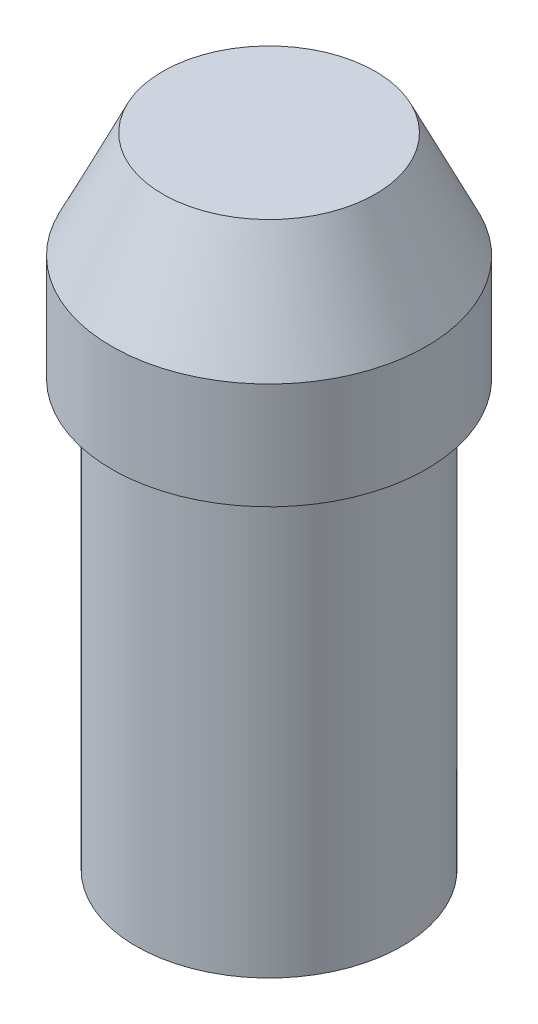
ISO-10303-21;
HEADER;
FILE_DESCRIPTION(('STEP AP214'),'2;1');
FILE_NAME('part.step','',(''),(''),'','','');
FILE_SCHEMA(('AUTOMOTIVE_DESIGN { 1 0 10303 214 1 1 1 1 }'));
ENDSEC;
DATA;
#1=APPLICATION_CONTEXT('core data for automotive mechanical design processes');
#2=APPLICATION_PROTOCOL_DEFINITION('international standard','automotive_design',2000,#1);
#3=PRODUCT_CONTEXT('',#1,'mechanical');
#4=PRODUCT('Part','Part','',(#3));
#5=PRODUCT_RELATED_PRODUCT_CATEGORY('part','',(#4));
#6=PRODUCT_DEFINITION_FORMATION('','',#4);
#7=PRODUCT_DEFINITION_CONTEXT('part definition',#1,'design');
#8=PRODUCT_DEFINITION('design','',#6,#7);
#9=PRODUCT_DEFINITION_SHAPE('','',#8);
#10=(LENGTH_UNIT() NAMED_UNIT(*) SI_UNIT(.MILLI.,.METRE.));
#11=(NAMED_UNIT(*) PLANE_ANGLE_UNIT() SI_UNIT($,.RADIAN.));
#12=(NAMED_UNIT(*) SI_UNIT($,.STERADIAN.) SOLID_ANGLE_UNIT());
#13=UNCERTAINTY_MEASURE_WITH_UNIT(LENGTH_MEASURE(1.E-05),#10,'distance_accuracy_value','');
#14=(GEOMETRIC_REPRESENTATION_CONTEXT(3) GLOBAL_UNCERTAINTY_ASSIGNED_CONTEXT((#13)) GLOBAL_UNIT_ASSIGNED_CONTEXT((#10,
#11,#12)) REPRESENTATION_CONTEXT('',''));
#15=CARTESIAN_POINT('',(0.,0.,0.));
#16=DIRECTION('',(0.,0.,1.));
#17=DIRECTION('',(1.,0.,0.));
#18=AXIS2_PLACEMENT_3D('',#15,#16,#17);
#19=CARTESIAN_POINT('',(0.,6.35,0.));
#20=DIRECTION('',(0.,-1.,0.));
#21=DIRECTION('',(1.,0.,0.));
#22=AXIS2_PLACEMENT_3D('',#19,#20,#21);
#23=PLANE('',#22);
#24=CARTESIAN_POINT('',(0.,6.35,0.));
#25=DIRECTION('',(0.,1.,0.));
#26=DIRECTION('',(-1.,0.,0.));
#27=AXIS2_PLACEMENT_3D('',#24,#25,#26);
#28=CIRCLE('',#27,3.175);
#29=CARTESIAN_POINT('',(-3.17500000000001,6.35,0.));
#30=VERTEX_POINT('',#29);
#31=EDGE_CURVE('E47',#30,#30,#28,.T.);
#32=ORIENTED_EDGE('',*,*,#31,.T.);
#33=EDGE_LOOP('',(#32));
#34=FACE_BOUND('',#33,.T.);
#35=ADVANCED_FACE('F28',(#34),#23,.F.);
#36=CARTESIAN_POINT('',(3.96875,-12.7,0.));
#37=DIRECTION('',(0.,1.,0.));
#38=DIRECTION('',(-1.,0.,0.));
#39=AXIS2_PLACEMENT_3D('',#36,#37,#38);
#40=PLANE('',#39);
#41=CARTESIAN_POINT('',(0.,-12.7,0.));
#42=DIRECTION('',(0.,1.,0.));
#43=DIRECTION('',(-1.,0.,0.));
#44=AXIS2_PLACEMENT_3D('',#41,#42,#43);
#45=CIRCLE('',#44,3.96875000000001);
#46=CARTESIAN_POINT('',(-3.96875000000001,-12.7,0.));
#47=VERTEX_POINT('',#46);
#48=EDGE_CURVE('E10',#47,#47,#45,.T.);
#49=ORIENTED_EDGE('',*,*,#48,.F.);
#50=EDGE_LOOP('',(#49));
#51=FACE_BOUND('',#50,.T.);
#52=ADVANCED_FACE('F71',(#51),#40,.F.);
#53=CARTESIAN_POINT('',(0.,-12.7,0.));
#54=DIRECTION('',(0.,1.,0.));
#55=DIRECTION('',(-1.,0.,0.));
#56=AXIS2_PLACEMENT_3D('',#53,#54,#55);
#57=CYLINDRICAL_SURFACE('',#56,3.96875000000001);
#58=CARTESIAN_POINT('',(0.,0.,0.));
#59=DIRECTION('',(0.,1.,0.));
#60=DIRECTION('',(-1.,0.,0.));
#61=AXIS2_PLACEMENT_3D('',#58,#59,#60);
#62=CIRCLE('',#61,3.96875);
#63=CARTESIAN_POINT('',(-3.96875000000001,0.,0.));
#64=VERTEX_POINT('',#63);
#65=EDGE_CURVE('E34',#64,#64,#62,.T.);
#66=ORIENTED_EDGE('',*,*,#65,.F.);
#67=EDGE_LOOP('',(#66));
#68=FACE_BOUND('',#67,.T.);
#69=ORIENTED_EDGE('',*,*,#48,.T.);
#70=EDGE_LOOP('',(#69));
#71=FACE_BOUND('',#70,.T.);
#72=ADVANCED_FACE('F66',(#68,#71),#57,.T.);
#73=CARTESIAN_POINT('',(4.699,0.,0.));
#74=DIRECTION('',(0.,1.,0.));
#75=DIRECTION('',(-1.,0.,0.));
#76=AXIS2_PLACEMENT_3D('',#73,#74,#75);
#77=PLANE('',#76);
#78=CARTESIAN_POINT('',(0.,0.,0.));
#79=DIRECTION('',(0.,1.,0.));
#80=DIRECTION('',(-1.,0.,0.));
#81=AXIS2_PLACEMENT_3D('',#78,#79,#80);
#82=CIRCLE('',#81,4.699);
#83=CARTESIAN_POINT('',(-4.69900000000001,0.,0.));
#84=VERTEX_POINT('',#83);
#85=EDGE_CURVE('E38',#84,#84,#82,.T.);
#86=ORIENTED_EDGE('',*,*,#85,.F.);
#87=EDGE_LOOP('',(#86));
#88=FACE_BOUND('',#87,.T.);
#89=ORIENTED_EDGE('',*,*,#65,.T.);
#90=EDGE_LOOP('',(#89));
#91=FACE_BOUND('',#90,.T.);
#92=ADVANCED_FACE('F61',(#88,#91),#77,.F.);
#93=CARTESIAN_POINT('',(0.,-12.7,0.));
#94=DIRECTION('',(0.,1.,0.));
#95=DIRECTION('',(-1.,0.,0.));
#96=AXIS2_PLACEMENT_3D('',#93,#94,#95);
#97=CYLINDRICAL_SURFACE('',#96,4.699);
#98=CARTESIAN_POINT('',(0.,3.175,0.));
#99=DIRECTION('',(0.,1.,0.));
#100=DIRECTION('',(-1.,0.,0.));
#101=AXIS2_PLACEMENT_3D('',#98,#99,#100);
#102=CIRCLE('',#101,4.699);
#103=CARTESIAN_POINT('',(-4.69900000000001,3.175,0.));
#104=VERTEX_POINT('',#103);
#105=EDGE_CURVE('E42',#104,#104,#102,.T.);
#106=ORIENTED_EDGE('',*,*,#105,.F.);
#107=EDGE_LOOP('',(#106));
#108=FACE_BOUND('',#107,.T.);
#109=ORIENTED_EDGE('',*,*,#85,.T.);
#110=EDGE_LOOP('',(#109));
#111=FACE_BOUND('',#110,.T.);
#112=ADVANCED_FACE('F55',(#108,#111),#97,.T.);
#113=CARTESIAN_POINT('',(0.,3.175,0.));
#114=DIRECTION('',(0.,-1.,0.));
#115=DIRECTION('',(1.,0.,0.));
#116=AXIS2_PLACEMENT_3D('',#113,#114,#115);
#117=CONICAL_SURFACE('',#116,4.699,0.44751997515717);
#118=ORIENTED_EDGE('',*,*,#31,.F.);
#119=EDGE_LOOP('',(#118));
#120=FACE_BOUND('',#119,.T.);
#121=ORIENTED_EDGE('',*,*,#105,.T.);
#122=EDGE_LOOP('',(#121));
#123=FACE_BOUND('',#122,.T.);
#124=ADVANCED_FACE('F52',(#120,#123),#117,.T.);
#125=CLOSED_SHELL('',(#35,#52,#72,#92,#112,#124));
#126=MANIFOLD_SOLID_BREP('B2',#125);
#127=ADVANCED_BREP_SHAPE_REPRESENTATION('',(#18,#126),#14);
#128=SHAPE_DEFINITION_REPRESENTATION(#9,#127);
ENDSEC;
END-ISO-10303-21;
